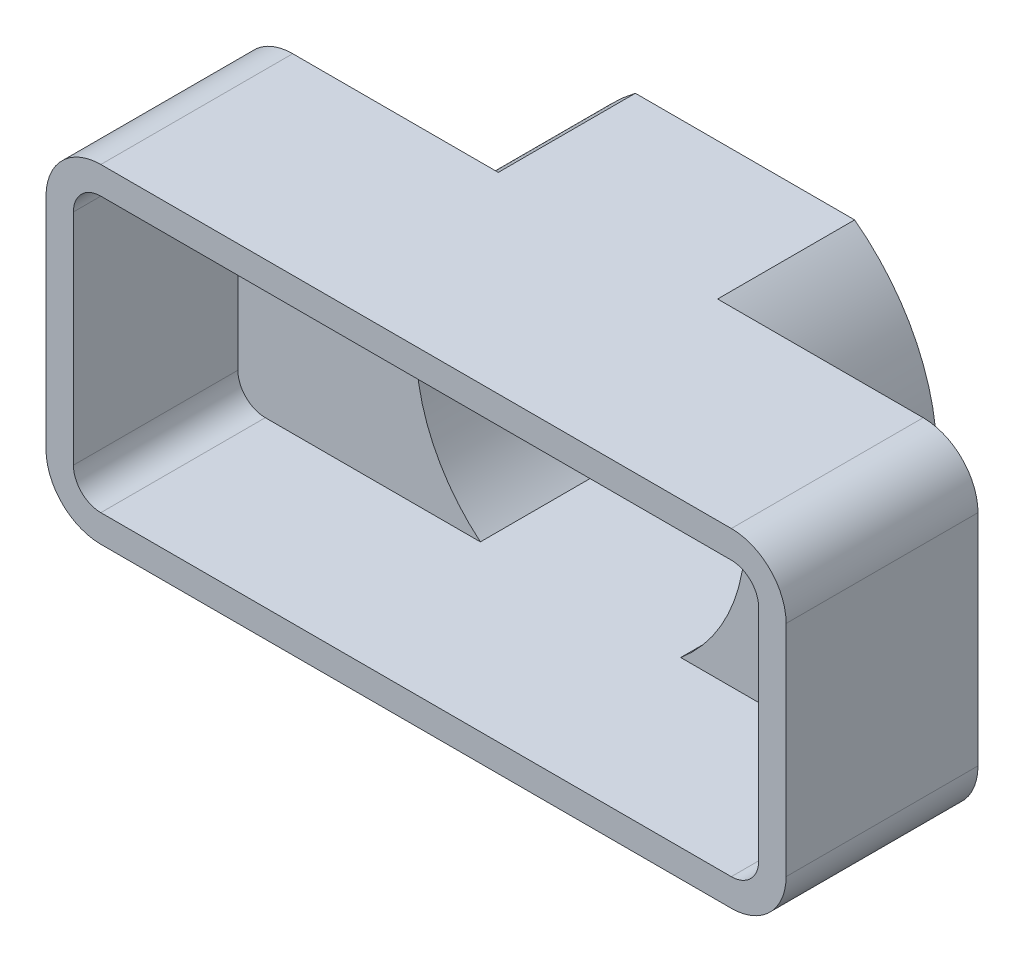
ISO-10303-21;
HEADER;
FILE_DESCRIPTION(('STEP AP214'),'2;1');
FILE_NAME('part.step','',(''),(''),'','','');
FILE_SCHEMA(('AUTOMOTIVE_DESIGN { 1 0 10303 214 1 1 1 1 }'));
ENDSEC;
DATA;
#1=APPLICATION_CONTEXT('core data for automotive mechanical design processes');
#2=APPLICATION_PROTOCOL_DEFINITION('international standard','automotive_design',2000,#1);
#3=PRODUCT_CONTEXT('',#1,'mechanical');
#4=PRODUCT('Part','Part','',(#3));
#5=PRODUCT_RELATED_PRODUCT_CATEGORY('part','',(#4));
#6=PRODUCT_DEFINITION_FORMATION('','',#4);
#7=PRODUCT_DEFINITION_CONTEXT('part definition',#1,'design');
#8=PRODUCT_DEFINITION('design','',#6,#7);
#9=PRODUCT_DEFINITION_SHAPE('','',#8);
#10=(LENGTH_UNIT() NAMED_UNIT(*) SI_UNIT(.MILLI.,.METRE.));
#11=(NAMED_UNIT(*) PLANE_ANGLE_UNIT() SI_UNIT($,.RADIAN.));
#12=(NAMED_UNIT(*) SI_UNIT($,.STERADIAN.) SOLID_ANGLE_UNIT());
#13=UNCERTAINTY_MEASURE_WITH_UNIT(LENGTH_MEASURE(1.E-05),#10,'distance_accuracy_value','');
#14=(GEOMETRIC_REPRESENTATION_CONTEXT(3) GLOBAL_UNCERTAINTY_ASSIGNED_CONTEXT((#13)) GLOBAL_UNIT_ASSIGNED_CONTEXT((#10,
#11,#12)) REPRESENTATION_CONTEXT('',''));
#15=CARTESIAN_POINT('',(0.,0.,0.));
#16=DIRECTION('',(0.,0.,1.));
#17=DIRECTION('',(1.,0.,0.));
#18=AXIS2_PLACEMENT_3D('',#15,#16,#17);
#19=CARTESIAN_POINT('',(-0.5,0.,5.));
#20=DIRECTION('',(0.,0.,-1.));
#21=DIRECTION('',(-1.,0.,0.));
#22=AXIS2_PLACEMENT_3D('',#19,#20,#21);
#23=CYLINDRICAL_SURFACE('',#22,6.5);
#24=DIRECTION('',(0.,0.,-1.));
#25=VECTOR('',#24,1.);
#26=CARTESIAN_POINT('',(3.65331193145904,5.,5.));
#27=LINE('',#26,#25);
#28=CARTESIAN_POINT('',(3.65331193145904,5.,6.));
#29=VERTEX_POINT('',#28);
#30=CARTESIAN_POINT('',(3.65331193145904,5.,1.));
#31=VERTEX_POINT('',#30);
#32=EDGE_CURVE('E204',#29,#31,#27,.T.);
#33=ORIENTED_EDGE('',*,*,#32,.T.);
#34=CARTESIAN_POINT('',(-0.5,0.,1.));
#35=DIRECTION('',(0.,0.,-1.));
#36=DIRECTION('',(-1.,0.,0.));
#37=AXIS2_PLACEMENT_3D('',#34,#35,#36);
#38=CIRCLE('',#37,6.5);
#39=CARTESIAN_POINT('',(3.65331193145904,-5.,1.));
#40=VERTEX_POINT('',#39);
#41=EDGE_CURVE('E192',#31,#40,#38,.T.);
#42=ORIENTED_EDGE('',*,*,#41,.T.);
#43=DIRECTION('',(0.,0.,-1.));
#44=VECTOR('',#43,1.);
#45=CARTESIAN_POINT('',(3.65331193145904,-5.,5.));
#46=LINE('',#45,#44);
#47=CARTESIAN_POINT('',(3.65331193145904,-5.,6.));
#48=VERTEX_POINT('',#47);
#49=EDGE_CURVE('E202',#48,#40,#46,.T.);
#50=ORIENTED_EDGE('',*,*,#49,.F.);
#51=CARTESIAN_POINT('',(-0.5,0.,6.));
#52=DIRECTION('',(0.,0.,-1.));
#53=DIRECTION('',(-1.,0.,0.));
#54=AXIS2_PLACEMENT_3D('',#51,#52,#53);
#55=CIRCLE('',#54,6.5);
#56=EDGE_CURVE('E256',#29,#48,#55,.T.);
#57=ORIENTED_EDGE('',*,*,#56,.F.);
#58=EDGE_LOOP('',(#33,#42,#50,#57));
#59=FACE_BOUND('',#58,.T.);
#60=ADVANCED_FACE('F31',(#59),#23,.F.);
#61=CARTESIAN_POINT('',(3.65331193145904,5.,5.));
#62=DIRECTION('',(0.,-1.,0.));
#63=DIRECTION('',(0.,0.,-1.));
#64=AXIS2_PLACEMENT_3D('',#61,#62,#63);
#65=PLANE('',#64);
#66=DIRECTION('',(0.,0.,-1.));
#67=VECTOR('',#66,1.);
#68=CARTESIAN_POINT('',(-3.65331193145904,5.,5.));
#69=LINE('',#68,#67);
#70=CARTESIAN_POINT('',(-3.65331193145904,5.,6.));
#71=VERTEX_POINT('',#70);
#72=CARTESIAN_POINT('',(-3.65331193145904,5.,1.));
#73=VERTEX_POINT('',#72);
#74=EDGE_CURVE('E215',#71,#73,#69,.T.);
#75=ORIENTED_EDGE('',*,*,#74,.T.);
#76=DIRECTION('',(1.,0.,0.));
#77=VECTOR('',#76,1.);
#78=CARTESIAN_POINT('',(3.65331193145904,5.,1.));
#79=LINE('',#78,#77);
#80=EDGE_CURVE('E206',#73,#31,#79,.T.);
#81=ORIENTED_EDGE('',*,*,#80,.T.);
#82=ORIENTED_EDGE('',*,*,#32,.F.);
#83=DIRECTION('',(-1.,0.,0.));
#84=VECTOR('',#83,1.);
#85=CARTESIAN_POINT('',(-11.5,5.,6.));
#86=LINE('',#85,#84);
#87=CARTESIAN_POINT('',(11.5,5.,6.));
#88=VERTEX_POINT('',#87);
#89=EDGE_CURVE('E701',#88,#29,#86,.T.);
#90=ORIENTED_EDGE('',*,*,#89,.F.);
#91=DIRECTION('',(0.,0.,1.));
#92=VECTOR('',#91,1.);
#93=CARTESIAN_POINT('',(11.5,5.,6.));
#94=LINE('',#93,#92);
#95=CARTESIAN_POINT('',(11.5,5.,12.));
#96=VERTEX_POINT('',#95);
#97=EDGE_CURVE('E281',#88,#96,#94,.T.);
#98=ORIENTED_EDGE('',*,*,#97,.T.);
#99=DIRECTION('',(-1.,0.,0.));
#100=VECTOR('',#99,1.);
#101=CARTESIAN_POINT('',(-3.65331193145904,5.,12.));
#102=LINE('',#101,#100);
#103=CARTESIAN_POINT('',(-11.5,5.,12.));
#104=VERTEX_POINT('',#103);
#105=EDGE_CURVE('E53',#96,#104,#102,.T.);
#106=ORIENTED_EDGE('',*,*,#105,.T.);
#107=DIRECTION('',(0.,0.,1.));
#108=VECTOR('',#107,1.);
#109=CARTESIAN_POINT('',(-11.5,5.,6.));
#110=LINE('',#109,#108);
#111=CARTESIAN_POINT('',(-11.5,5.,6.));
#112=VERTEX_POINT('',#111);
#113=EDGE_CURVE('E278',#112,#104,#110,.T.);
#114=ORIENTED_EDGE('',*,*,#113,.F.);
#115=EDGE_CURVE('E700',#71,#112,#86,.T.);
#116=ORIENTED_EDGE('',*,*,#115,.F.);
#117=EDGE_LOOP('',(#75,#81,#82,#90,#98,#106,#114,#116));
#118=FACE_BOUND('',#117,.T.);
#119=ADVANCED_FACE('F436',(#118),#65,.T.);
#120=CARTESIAN_POINT('',(0.5,0.,5.));
#121=DIRECTION('',(0.,0.,-1.));
#122=DIRECTION('',(-1.,0.,0.));
#123=AXIS2_PLACEMENT_3D('',#120,#121,#122);
#124=CYLINDRICAL_SURFACE('',#123,6.5);
#125=DIRECTION('',(0.,0.,-1.));
#126=VECTOR('',#125,1.);
#127=CARTESIAN_POINT('',(-3.65331193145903,-5.,5.));
#128=LINE('',#127,#126);
#129=CARTESIAN_POINT('',(-3.65331193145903,-5.,6.));
#130=VERTEX_POINT('',#129);
#131=CARTESIAN_POINT('',(-3.65331193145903,-5.,1.));
#132=VERTEX_POINT('',#131);
#133=EDGE_CURVE('E212',#130,#132,#128,.T.);
#134=ORIENTED_EDGE('',*,*,#133,.T.);
#135=CARTESIAN_POINT('',(0.5,0.,1.));
#136=DIRECTION('',(0.,0.,-1.));
#137=DIRECTION('',(-1.,0.,0.));
#138=AXIS2_PLACEMENT_3D('',#135,#136,#137);
#139=CIRCLE('',#138,6.5);
#140=EDGE_CURVE('E46',#132,#73,#139,.T.);
#141=ORIENTED_EDGE('',*,*,#140,.T.);
#142=ORIENTED_EDGE('',*,*,#74,.F.);
#143=CARTESIAN_POINT('',(0.5,0.,6.));
#144=DIRECTION('',(0.,0.,-1.));
#145=DIRECTION('',(-1.,0.,0.));
#146=AXIS2_PLACEMENT_3D('',#143,#144,#145);
#147=CIRCLE('',#146,6.5);
#148=EDGE_CURVE('E252',#130,#71,#147,.T.);
#149=ORIENTED_EDGE('',*,*,#148,.F.);
#150=EDGE_LOOP('',(#134,#141,#142,#149));
#151=FACE_BOUND('',#150,.T.);
#152=ADVANCED_FACE('F441',(#151),#124,.F.);
#153=CARTESIAN_POINT('',(3.65331193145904,-5.,5.));
#154=DIRECTION('',(0.,1.,0.));
#155=DIRECTION('',(0.,0.,1.));
#156=AXIS2_PLACEMENT_3D('',#153,#154,#155);
#157=PLANE('',#156);
#158=ORIENTED_EDGE('',*,*,#49,.T.);
#159=DIRECTION('',(-1.,0.,0.));
#160=VECTOR('',#159,1.);
#161=CARTESIAN_POINT('',(3.65331193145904,-5.,1.));
#162=LINE('',#161,#160);
#163=EDGE_CURVE('E11',#40,#132,#162,.T.);
#164=ORIENTED_EDGE('',*,*,#163,.T.);
#165=ORIENTED_EDGE('',*,*,#133,.F.);
#166=DIRECTION('',(1.,0.,0.));
#167=VECTOR('',#166,1.);
#168=CARTESIAN_POINT('',(-11.5,-5.,6.));
#169=LINE('',#168,#167);
#170=CARTESIAN_POINT('',(-11.5,-5.,6.));
#171=VERTEX_POINT('',#170);
#172=EDGE_CURVE('E712',#171,#130,#169,.T.);
#173=ORIENTED_EDGE('',*,*,#172,.F.);
#174=DIRECTION('',(0.,0.,1.));
#175=VECTOR('',#174,1.);
#176=CARTESIAN_POINT('',(-11.5,-5.,6.));
#177=LINE('',#176,#175);
#178=CARTESIAN_POINT('',(-11.5,-5.,12.));
#179=VERTEX_POINT('',#178);
#180=EDGE_CURVE('E271',#171,#179,#177,.T.);
#181=ORIENTED_EDGE('',*,*,#180,.T.);
#182=DIRECTION('',(1.,0.,0.));
#183=VECTOR('',#182,1.);
#184=CARTESIAN_POINT('',(-3.65331193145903,-5.,12.));
#185=LINE('',#184,#183);
#186=CARTESIAN_POINT('',(11.5,-5.,12.));
#187=VERTEX_POINT('',#186);
#188=EDGE_CURVE('E289',#179,#187,#185,.T.);
#189=ORIENTED_EDGE('',*,*,#188,.T.);
#190=DIRECTION('',(0.,0.,1.));
#191=VECTOR('',#190,1.);
#192=CARTESIAN_POINT('',(11.5,-5.,6.));
#193=LINE('',#192,#191);
#194=CARTESIAN_POINT('',(11.5,-5.,6.));
#195=VERTEX_POINT('',#194);
#196=EDGE_CURVE('E263',#195,#187,#193,.T.);
#197=ORIENTED_EDGE('',*,*,#196,.F.);
#198=EDGE_CURVE('E211',#48,#195,#169,.T.);
#199=ORIENTED_EDGE('',*,*,#198,.F.);
#200=EDGE_LOOP('',(#158,#164,#165,#173,#181,#189,#197,#199));
#201=FACE_BOUND('',#200,.T.);
#202=ADVANCED_FACE('F209',(#201),#157,.T.);
#203=CARTESIAN_POINT('',(-0.5,0.,0.));
#204=DIRECTION('',(0.,0.,-1.));
#205=DIRECTION('',(-1.,0.,0.));
#206=AXIS2_PLACEMENT_3D('',#203,#204,#205);
#207=PLANE('',#206);
#208=CARTESIAN_POINT('',(-0.5,0.,0.));
#209=DIRECTION('',(0.,0.,1.));
#210=DIRECTION('',(-1.,0.,0.));
#211=AXIS2_PLACEMENT_3D('',#208,#209,#210);
#212=CIRCLE('',#211,7.5);
#213=CARTESIAN_POINT('',(4.,-6.,0.));
#214=VERTEX_POINT('',#213);
#215=CARTESIAN_POINT('',(4.,6.,0.));
#216=VERTEX_POINT('',#215);
#217=EDGE_CURVE('E228',#214,#216,#212,.T.);
#218=ORIENTED_EDGE('',*,*,#217,.F.);
#219=DIRECTION('',(1.,0.,0.));
#220=VECTOR('',#219,1.);
#221=CARTESIAN_POINT('',(4.,-6.,0.));
#222=LINE('',#221,#220);
#223=CARTESIAN_POINT('',(-4.,-6.,0.));
#224=VERTEX_POINT('',#223);
#225=EDGE_CURVE('E239',#224,#214,#222,.T.);
#226=ORIENTED_EDGE('',*,*,#225,.F.);
#227=CARTESIAN_POINT('',(0.5,0.,0.));
#228=DIRECTION('',(0.,0.,1.));
#229=DIRECTION('',(1.,0.,0.));
#230=AXIS2_PLACEMENT_3D('',#227,#228,#229);
#231=CIRCLE('',#230,7.5);
#232=CARTESIAN_POINT('',(-4.,6.,0.));
#233=VERTEX_POINT('',#232);
#234=EDGE_CURVE('E397',#233,#224,#231,.T.);
#235=ORIENTED_EDGE('',*,*,#234,.F.);
#236=DIRECTION('',(-1.,0.,0.));
#237=VECTOR('',#236,1.);
#238=CARTESIAN_POINT('',(4.,6.,0.));
#239=LINE('',#238,#237);
#240=EDGE_CURVE('E387',#216,#233,#239,.T.);
#241=ORIENTED_EDGE('',*,*,#240,.F.);
#242=EDGE_LOOP('',(#218,#226,#235,#241));
#243=FACE_BOUND('',#242,.T.);
#244=CARTESIAN_POINT('',(0.,0.,0.));
#245=DIRECTION('',(0.,0.,-1.));
#246=DIRECTION('',(-1.,0.,0.));
#247=AXIS2_PLACEMENT_3D('',#244,#245,#246);
#248=CIRCLE('',#247,1.);
#249=CARTESIAN_POINT('',(-1.,0.,0.));
#250=VERTEX_POINT('',#249);
#251=EDGE_CURVE('E691',#250,#250,#248,.T.);
#252=ORIENTED_EDGE('',*,*,#251,.F.);
#253=EDGE_LOOP('',(#252));
#254=FACE_BOUND('',#253,.T.);
#255=ADVANCED_FACE('F405',(#243,#254),#207,.T.);
#256=CARTESIAN_POINT('',(-0.5,0.,5.));
#257=DIRECTION('',(0.,0.,-1.));
#258=DIRECTION('',(-1.,0.,0.));
#259=AXIS2_PLACEMENT_3D('',#256,#257,#258);
#260=CYLINDRICAL_SURFACE('',#259,7.5);
#261=ORIENTED_EDGE('',*,*,#217,.T.);
#262=DIRECTION('',(0.,0.,-1.));
#263=VECTOR('',#262,1.);
#264=CARTESIAN_POINT('',(4.,6.,5.));
#265=LINE('',#264,#263);
#266=CARTESIAN_POINT('',(4.,6.,5.));
#267=VERTEX_POINT('',#266);
#268=EDGE_CURVE('E39',#267,#216,#265,.T.);
#269=ORIENTED_EDGE('',*,*,#268,.F.);
#270=CARTESIAN_POINT('',(-0.5,0.,5.));
#271=DIRECTION('',(0.,0.,1.));
#272=DIRECTION('',(-1.,0.,0.));
#273=AXIS2_PLACEMENT_3D('',#270,#271,#272);
#274=CIRCLE('',#273,7.5);
#275=CARTESIAN_POINT('',(4.,-6.,5.));
#276=VERTEX_POINT('',#275);
#277=EDGE_CURVE('E234',#276,#267,#274,.T.);
#278=ORIENTED_EDGE('',*,*,#277,.F.);
#279=DIRECTION('',(0.,0.,-1.));
#280=VECTOR('',#279,1.);
#281=CARTESIAN_POINT('',(4.,-6.,5.));
#282=LINE('',#281,#280);
#283=EDGE_CURVE('E246',#276,#214,#282,.T.);
#284=ORIENTED_EDGE('',*,*,#283,.T.);
#285=EDGE_LOOP('',(#261,#269,#278,#284));
#286=FACE_BOUND('',#285,.T.);
#287=ADVANCED_FACE('F33',(#286),#260,.T.);
#288=CARTESIAN_POINT('',(4.,6.,5.));
#289=DIRECTION('',(0.,-1.,0.));
#290=DIRECTION('',(1.,0.,0.));
#291=AXIS2_PLACEMENT_3D('',#288,#289,#290);
#292=PLANE('',#291);
#293=ORIENTED_EDGE('',*,*,#240,.T.);
#294=DIRECTION('',(0.,0.,-1.));
#295=VECTOR('',#294,1.);
#296=CARTESIAN_POINT('',(-4.,6.,5.));
#297=LINE('',#296,#295);
#298=CARTESIAN_POINT('',(-4.,6.,5.));
#299=VERTEX_POINT('',#298);
#300=EDGE_CURVE('E243',#299,#233,#297,.T.);
#301=ORIENTED_EDGE('',*,*,#300,.F.);
#302=DIRECTION('',(-1.,0.,0.));
#303=VECTOR('',#302,1.);
#304=CARTESIAN_POINT('',(-11.5,6.,5.));
#305=LINE('',#304,#303);
#306=CARTESIAN_POINT('',(-11.5,6.,5.));
#307=VERTEX_POINT('',#306);
#308=EDGE_CURVE('E325',#299,#307,#305,.T.);
#309=ORIENTED_EDGE('',*,*,#308,.T.);
#310=DIRECTION('',(0.,0.,-1.));
#311=VECTOR('',#310,1.);
#312=CARTESIAN_POINT('',(-11.5,6.,12.));
#313=LINE('',#312,#311);
#314=CARTESIAN_POINT('',(-11.5,6.,12.));
#315=VERTEX_POINT('',#314);
#316=EDGE_CURVE('E311',#315,#307,#313,.T.);
#317=ORIENTED_EDGE('',*,*,#316,.F.);
#318=DIRECTION('',(-1.,0.,0.));
#319=VECTOR('',#318,1.);
#320=CARTESIAN_POINT('',(-11.5,6.,12.));
#321=LINE('',#320,#319);
#322=CARTESIAN_POINT('',(11.5,6.,12.));
#323=VERTEX_POINT('',#322);
#324=EDGE_CURVE('E309',#323,#315,#321,.T.);
#325=ORIENTED_EDGE('',*,*,#324,.F.);
#326=DIRECTION('',(0.,0.,-1.));
#327=VECTOR('',#326,1.);
#328=CARTESIAN_POINT('',(11.5,6.,12.));
#329=LINE('',#328,#327);
#330=CARTESIAN_POINT('',(11.5,6.,5.));
#331=VERTEX_POINT('',#330);
#332=EDGE_CURVE('E335',#323,#331,#329,.T.);
#333=ORIENTED_EDGE('',*,*,#332,.T.);
#334=EDGE_CURVE('E297',#331,#267,#305,.T.);
#335=ORIENTED_EDGE('',*,*,#334,.T.);
#336=ORIENTED_EDGE('',*,*,#268,.T.);
#337=EDGE_LOOP('',(#293,#301,#309,#317,#325,#333,#335,#336));
#338=FACE_BOUND('',#337,.T.);
#339=ADVANCED_FACE('F384',(#338),#292,.F.);
#340=CARTESIAN_POINT('',(0.5,0.,5.));
#341=DIRECTION('',(0.,0.,-1.));
#342=DIRECTION('',(-1.,0.,0.));
#343=AXIS2_PLACEMENT_3D('',#340,#341,#342);
#344=CYLINDRICAL_SURFACE('',#343,7.5);
#345=ORIENTED_EDGE('',*,*,#234,.T.);
#346=DIRECTION('',(0.,0.,-1.));
#347=VECTOR('',#346,1.);
#348=CARTESIAN_POINT('',(-4.,-6.,5.));
#349=LINE('',#348,#347);
#350=CARTESIAN_POINT('',(-4.,-6.,5.));
#351=VERTEX_POINT('',#350);
#352=EDGE_CURVE('E248',#351,#224,#349,.T.);
#353=ORIENTED_EDGE('',*,*,#352,.F.);
#354=CARTESIAN_POINT('',(0.5,0.,5.));
#355=DIRECTION('',(0.,0.,1.));
#356=DIRECTION('',(1.,0.,0.));
#357=AXIS2_PLACEMENT_3D('',#354,#355,#356);
#358=CIRCLE('',#357,7.5);
#359=EDGE_CURVE('E238',#299,#351,#358,.T.);
#360=ORIENTED_EDGE('',*,*,#359,.F.);
#361=ORIENTED_EDGE('',*,*,#300,.T.);
#362=EDGE_LOOP('',(#345,#353,#360,#361));
#363=FACE_BOUND('',#362,.T.);
#364=ADVANCED_FACE('F390',(#363),#344,.T.);
#365=CARTESIAN_POINT('',(4.,-6.,5.));
#366=DIRECTION('',(0.,1.,0.));
#367=DIRECTION('',(-1.,0.,0.));
#368=AXIS2_PLACEMENT_3D('',#365,#366,#367);
#369=PLANE('',#368);
#370=ORIENTED_EDGE('',*,*,#225,.T.);
#371=ORIENTED_EDGE('',*,*,#283,.F.);
#372=DIRECTION('',(1.,0.,0.));
#373=VECTOR('',#372,1.);
#374=CARTESIAN_POINT('',(-11.5,-6.,5.));
#375=LINE('',#374,#373);
#376=CARTESIAN_POINT('',(11.5,-6.,5.));
#377=VERTEX_POINT('',#376);
#378=EDGE_CURVE('E221',#276,#377,#375,.T.);
#379=ORIENTED_EDGE('',*,*,#378,.T.);
#380=DIRECTION('',(0.,0.,-1.));
#381=VECTOR('',#380,1.);
#382=CARTESIAN_POINT('',(11.5,-6.,12.));
#383=LINE('',#382,#381);
#384=CARTESIAN_POINT('',(11.5,-6.,12.));
#385=VERTEX_POINT('',#384);
#386=EDGE_CURVE('E344',#385,#377,#383,.T.);
#387=ORIENTED_EDGE('',*,*,#386,.F.);
#388=DIRECTION('',(1.,0.,0.));
#389=VECTOR('',#388,1.);
#390=CARTESIAN_POINT('',(-11.5,-6.,12.));
#391=LINE('',#390,#389);
#392=CARTESIAN_POINT('',(-11.5,-6.,12.));
#393=VERTEX_POINT('',#392);
#394=EDGE_CURVE('E301',#393,#385,#391,.T.);
#395=ORIENTED_EDGE('',*,*,#394,.F.);
#396=DIRECTION('',(0.,0.,-1.));
#397=VECTOR('',#396,1.);
#398=CARTESIAN_POINT('',(-11.5,-6.,12.));
#399=LINE('',#398,#397);
#400=CARTESIAN_POINT('',(-11.5,-6.,5.));
#401=VERTEX_POINT('',#400);
#402=EDGE_CURVE('E347',#393,#401,#399,.T.);
#403=ORIENTED_EDGE('',*,*,#402,.T.);
#404=EDGE_CURVE('E322',#401,#351,#375,.T.);
#405=ORIENTED_EDGE('',*,*,#404,.T.);
#406=ORIENTED_EDGE('',*,*,#352,.T.);
#407=EDGE_LOOP('',(#370,#371,#379,#387,#395,#403,#405,#406));
#408=FACE_BOUND('',#407,.T.);
#409=ADVANCED_FACE('F368',(#408),#369,.F.);
#410=CARTESIAN_POINT('',(-11.5,4.,5.));
#411=DIRECTION('',(0.,0.,-1.));
#412=DIRECTION('',(-1.,0.,0.));
#413=AXIS2_PLACEMENT_3D('',#410,#411,#412);
#414=PLANE('',#413);
#415=ORIENTED_EDGE('',*,*,#378,.F.);
#416=ORIENTED_EDGE('',*,*,#277,.T.);
#417=ORIENTED_EDGE('',*,*,#334,.F.);
#418=CARTESIAN_POINT('',(11.5,4.,5.));
#419=DIRECTION('',(0.,0.,1.));
#420=DIRECTION('',(-1.,0.,0.));
#421=AXIS2_PLACEMENT_3D('',#418,#419,#420);
#422=CIRCLE('',#421,2.);
#423=CARTESIAN_POINT('',(13.5,4.,5.));
#424=VERTEX_POINT('',#423);
#425=EDGE_CURVE('E328',#424,#331,#422,.T.);
#426=ORIENTED_EDGE('',*,*,#425,.F.);
#427=DIRECTION('',(0.,1.,0.));
#428=VECTOR('',#427,1.);
#429=CARTESIAN_POINT('',(13.5,-4.,5.));
#430=LINE('',#429,#428);
#431=CARTESIAN_POINT('',(13.5,-4.,5.));
#432=VERTEX_POINT('',#431);
#433=EDGE_CURVE('E415',#432,#424,#430,.T.);
#434=ORIENTED_EDGE('',*,*,#433,.F.);
#435=CARTESIAN_POINT('',(11.5,-4.,5.));
#436=DIRECTION('',(0.,0.,1.));
#437=DIRECTION('',(1.,0.,0.));
#438=AXIS2_PLACEMENT_3D('',#435,#436,#437);
#439=CIRCLE('',#438,2.);
#440=EDGE_CURVE('E319',#377,#432,#439,.T.);
#441=ORIENTED_EDGE('',*,*,#440,.F.);
#442=EDGE_LOOP('',(#415,#416,#417,#426,#434,#441));
#443=FACE_BOUND('',#442,.T.);
#444=ADVANCED_FACE('F412',(#443),#414,.T.);
#445=CARTESIAN_POINT('',(-11.5,4.,12.));
#446=DIRECTION('',(0.,0.,-1.));
#447=DIRECTION('',(-1.,0.,0.));
#448=AXIS2_PLACEMENT_3D('',#445,#446,#447);
#449=PLANE('',#448);
#450=ORIENTED_EDGE('',*,*,#188,.F.);
#451=CARTESIAN_POINT('',(-11.5,-4.,12.));
#452=DIRECTION('',(0.,0.,1.));
#453=DIRECTION('',(-1.,0.,0.));
#454=AXIS2_PLACEMENT_3D('',#451,#452,#453);
#455=CIRCLE('',#454,0.999999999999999);
#456=CARTESIAN_POINT('',(-12.5,-4.,12.));
#457=VERTEX_POINT('',#456);
#458=EDGE_CURVE('E726',#457,#179,#455,.T.);
#459=ORIENTED_EDGE('',*,*,#458,.F.);
#460=DIRECTION('',(0.,-1.,0.));
#461=VECTOR('',#460,1.);
#462=CARTESIAN_POINT('',(-12.5,-4.,12.));
#463=LINE('',#462,#461);
#464=CARTESIAN_POINT('',(-12.5,4.,12.));
#465=VERTEX_POINT('',#464);
#466=EDGE_CURVE('E723',#465,#457,#463,.T.);
#467=ORIENTED_EDGE('',*,*,#466,.F.);
#468=CARTESIAN_POINT('',(-11.5,4.,12.));
#469=DIRECTION('',(0.,0.,1.));
#470=DIRECTION('',(-1.,0.,0.));
#471=AXIS2_PLACEMENT_3D('',#468,#469,#470);
#472=CIRCLE('',#471,0.999999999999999);
#473=EDGE_CURVE('E720',#104,#465,#472,.T.);
#474=ORIENTED_EDGE('',*,*,#473,.F.);
#475=ORIENTED_EDGE('',*,*,#105,.F.);
#476=CARTESIAN_POINT('',(11.5,4.,12.));
#477=DIRECTION('',(0.,0.,1.));
#478=DIRECTION('',(-1.,0.,0.));
#479=AXIS2_PLACEMENT_3D('',#476,#477,#478);
#480=CIRCLE('',#479,0.999999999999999);
#481=CARTESIAN_POINT('',(12.5,4.,12.));
#482=VERTEX_POINT('',#481);
#483=EDGE_CURVE('E205',#482,#96,#480,.T.);
#484=ORIENTED_EDGE('',*,*,#483,.F.);
#485=DIRECTION('',(0.,1.,0.));
#486=VECTOR('',#485,1.);
#487=CARTESIAN_POINT('',(12.5,-4.,12.));
#488=LINE('',#487,#486);
#489=CARTESIAN_POINT('',(12.5,-4.,12.));
#490=VERTEX_POINT('',#489);
#491=EDGE_CURVE('E266',#490,#482,#488,.T.);
#492=ORIENTED_EDGE('',*,*,#491,.F.);
#493=CARTESIAN_POINT('',(11.5,-4.,12.));
#494=DIRECTION('',(0.,0.,1.));
#495=DIRECTION('',(1.,0.,0.));
#496=AXIS2_PLACEMENT_3D('',#493,#494,#495);
#497=CIRCLE('',#496,0.999999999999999);
#498=EDGE_CURVE('E728',#187,#490,#497,.T.);
#499=ORIENTED_EDGE('',*,*,#498,.F.);
#500=EDGE_LOOP('',(#450,#459,#467,#474,#475,#484,#492,#499));
#501=FACE_BOUND('',#500,.T.);
#502=CARTESIAN_POINT('',(-11.5,4.,12.));
#503=DIRECTION('',(0.,0.,1.));
#504=DIRECTION('',(-1.,0.,0.));
#505=AXIS2_PLACEMENT_3D('',#502,#503,#504);
#506=CIRCLE('',#505,2.);
#507=CARTESIAN_POINT('',(-13.5,4.,12.));
#508=VERTEX_POINT('',#507);
#509=EDGE_CURVE('E293',#315,#508,#506,.T.);
#510=ORIENTED_EDGE('',*,*,#509,.T.);
#511=DIRECTION('',(0.,-1.,0.));
#512=VECTOR('',#511,1.);
#513=CARTESIAN_POINT('',(-13.5,-4.,12.));
#514=LINE('',#513,#512);
#515=CARTESIAN_POINT('',(-13.5,-4.,12.));
#516=VERTEX_POINT('',#515);
#517=EDGE_CURVE('E296',#508,#516,#514,.T.);
#518=ORIENTED_EDGE('',*,*,#517,.T.);
#519=CARTESIAN_POINT('',(-11.5,-4.,12.));
#520=DIRECTION('',(0.,0.,1.));
#521=DIRECTION('',(-1.,0.,0.));
#522=AXIS2_PLACEMENT_3D('',#519,#520,#521);
#523=CIRCLE('',#522,2.);
#524=EDGE_CURVE('E299',#516,#393,#523,.T.);
#525=ORIENTED_EDGE('',*,*,#524,.T.);
#526=ORIENTED_EDGE('',*,*,#394,.T.);
#527=CARTESIAN_POINT('',(11.5,-4.,12.));
#528=DIRECTION('',(0.,0.,1.));
#529=DIRECTION('',(1.,0.,0.));
#530=AXIS2_PLACEMENT_3D('',#527,#528,#529);
#531=CIRCLE('',#530,2.);
#532=CARTESIAN_POINT('',(13.5,-4.,12.));
#533=VERTEX_POINT('',#532);
#534=EDGE_CURVE('E303',#385,#533,#531,.T.);
#535=ORIENTED_EDGE('',*,*,#534,.T.);
#536=DIRECTION('',(0.,1.,0.));
#537=VECTOR('',#536,1.);
#538=CARTESIAN_POINT('',(13.5,-4.,12.));
#539=LINE('',#538,#537);
#540=CARTESIAN_POINT('',(13.5,4.,12.));
#541=VERTEX_POINT('',#540);
#542=EDGE_CURVE('E305',#533,#541,#539,.T.);
#543=ORIENTED_EDGE('',*,*,#542,.T.);
#544=CARTESIAN_POINT('',(11.5,4.,12.));
#545=DIRECTION('',(0.,0.,1.));
#546=DIRECTION('',(-1.,0.,0.));
#547=AXIS2_PLACEMENT_3D('',#544,#545,#546);
#548=CIRCLE('',#547,2.);
#549=EDGE_CURVE('E307',#541,#323,#548,.T.);
#550=ORIENTED_EDGE('',*,*,#549,.T.);
#551=ORIENTED_EDGE('',*,*,#324,.T.);
#552=EDGE_LOOP('',(#510,#518,#525,#526,#535,#543,#550,#551));
#553=FACE_BOUND('',#552,.T.);
#554=ADVANCED_FACE('F374',(#501,#553),#449,.F.);
#555=ORIENTED_EDGE('',*,*,#308,.F.);
#556=ORIENTED_EDGE('',*,*,#359,.T.);
#557=ORIENTED_EDGE('',*,*,#404,.F.);
#558=CARTESIAN_POINT('',(-11.5,-4.,5.));
#559=DIRECTION('',(0.,0.,1.));
#560=DIRECTION('',(-1.,0.,0.));
#561=AXIS2_PLACEMENT_3D('',#558,#559,#560);
#562=CIRCLE('',#561,2.);
#563=CARTESIAN_POINT('',(-13.5,-4.,5.));
#564=VERTEX_POINT('',#563);
#565=EDGE_CURVE('E316',#564,#401,#562,.T.);
#566=ORIENTED_EDGE('',*,*,#565,.F.);
#567=DIRECTION('',(0.,-1.,0.));
#568=VECTOR('',#567,1.);
#569=CARTESIAN_POINT('',(-13.5,-4.,5.));
#570=LINE('',#569,#568);
#571=CARTESIAN_POINT('',(-13.5,4.,5.));
#572=VERTEX_POINT('',#571);
#573=EDGE_CURVE('E314',#572,#564,#570,.T.);
#574=ORIENTED_EDGE('',*,*,#573,.F.);
#575=CARTESIAN_POINT('',(-11.5,4.,5.));
#576=DIRECTION('',(0.,0.,1.));
#577=DIRECTION('',(-1.,0.,0.));
#578=AXIS2_PLACEMENT_3D('',#575,#576,#577);
#579=CIRCLE('',#578,2.);
#580=EDGE_CURVE('E292',#307,#572,#579,.T.);
#581=ORIENTED_EDGE('',*,*,#580,.F.);
#582=EDGE_LOOP('',(#555,#556,#557,#566,#574,#581));
#583=FACE_BOUND('',#582,.T.);
#584=CARTESIAN_POINT('',(-11.5,0.,5.));
#585=DIRECTION('',(0.,0.,1.));
#586=DIRECTION('',(1.,0.,0.));
#587=AXIS2_PLACEMENT_3D('',#584,#585,#586);
#588=CIRCLE('',#587,0.500000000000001);
#589=CARTESIAN_POINT('',(-11.,0.,5.));
#590=VERTEX_POINT('',#589);
#591=EDGE_CURVE('E286',#590,#590,#588,.T.);
#592=ORIENTED_EDGE('',*,*,#591,.T.);
#593=EDGE_LOOP('',(#592));
#594=FACE_BOUND('',#593,.T.);
#595=ADVANCED_FACE('F361',(#583,#594),#414,.T.);
#596=CARTESIAN_POINT('',(-11.5,4.,12.));
#597=DIRECTION('',(0.,0.,-1.));
#598=DIRECTION('',(-1.,0.,0.));
#599=AXIS2_PLACEMENT_3D('',#596,#597,#598);
#600=CYLINDRICAL_SURFACE('',#599,2.);
#601=ORIENTED_EDGE('',*,*,#580,.T.);
#602=DIRECTION('',(0.,0.,-1.));
#603=VECTOR('',#602,1.);
#604=CARTESIAN_POINT('',(-13.5,4.,12.));
#605=LINE('',#604,#603);
#606=EDGE_CURVE('E213',#508,#572,#605,.T.);
#607=ORIENTED_EDGE('',*,*,#606,.F.);
#608=ORIENTED_EDGE('',*,*,#509,.F.);
#609=ORIENTED_EDGE('',*,*,#316,.T.);
#610=EDGE_LOOP('',(#601,#607,#608,#609));
#611=FACE_BOUND('',#610,.T.);
#612=ADVANCED_FACE('F380',(#611),#600,.T.);
#613=CARTESIAN_POINT('',(-13.5,-4.,12.));
#614=DIRECTION('',(1.,0.,0.));
#615=DIRECTION('',(0.,0.,-1.));
#616=AXIS2_PLACEMENT_3D('',#613,#614,#615);
#617=PLANE('',#616);
#618=ORIENTED_EDGE('',*,*,#573,.T.);
#619=DIRECTION('',(0.,0.,-1.));
#620=VECTOR('',#619,1.);
#621=CARTESIAN_POINT('',(-13.5,-4.,12.));
#622=LINE('',#621,#620);
#623=EDGE_CURVE('E218',#516,#564,#622,.T.);
#624=ORIENTED_EDGE('',*,*,#623,.F.);
#625=ORIENTED_EDGE('',*,*,#517,.F.);
#626=ORIENTED_EDGE('',*,*,#606,.T.);
#627=EDGE_LOOP('',(#618,#624,#625,#626));
#628=FACE_BOUND('',#627,.T.);
#629=ADVANCED_FACE('F378',(#628),#617,.F.);
#630=CARTESIAN_POINT('',(-11.5,-4.,12.));
#631=DIRECTION('',(0.,0.,-1.));
#632=DIRECTION('',(-1.,0.,0.));
#633=AXIS2_PLACEMENT_3D('',#630,#631,#632);
#634=CYLINDRICAL_SURFACE('',#633,2.);
#635=ORIENTED_EDGE('',*,*,#565,.T.);
#636=ORIENTED_EDGE('',*,*,#402,.F.);
#637=ORIENTED_EDGE('',*,*,#524,.F.);
#638=ORIENTED_EDGE('',*,*,#623,.T.);
#639=EDGE_LOOP('',(#635,#636,#637,#638));
#640=FACE_BOUND('',#639,.T.);
#641=ADVANCED_FACE('F355',(#640),#634,.T.);
#642=CARTESIAN_POINT('',(11.5,-4.,12.));
#643=DIRECTION('',(0.,0.,-1.));
#644=DIRECTION('',(-1.,0.,0.));
#645=AXIS2_PLACEMENT_3D('',#642,#643,#644);
#646=CYLINDRICAL_SURFACE('',#645,2.);
#647=ORIENTED_EDGE('',*,*,#440,.T.);
#648=DIRECTION('',(0.,0.,-1.));
#649=VECTOR('',#648,1.);
#650=CARTESIAN_POINT('',(13.5,-4.,12.));
#651=LINE('',#650,#649);
#652=EDGE_CURVE('E341',#533,#432,#651,.T.);
#653=ORIENTED_EDGE('',*,*,#652,.F.);
#654=ORIENTED_EDGE('',*,*,#534,.F.);
#655=ORIENTED_EDGE('',*,*,#386,.T.);
#656=EDGE_LOOP('',(#647,#653,#654,#655));
#657=FACE_BOUND('',#656,.T.);
#658=ADVANCED_FACE('F426',(#657),#646,.T.);
#659=CARTESIAN_POINT('',(13.5,-4.,12.));
#660=DIRECTION('',(-1.,0.,0.));
#661=DIRECTION('',(0.,0.,1.));
#662=AXIS2_PLACEMENT_3D('',#659,#660,#661);
#663=PLANE('',#662);
#664=ORIENTED_EDGE('',*,*,#433,.T.);
#665=DIRECTION('',(0.,0.,-1.));
#666=VECTOR('',#665,1.);
#667=CARTESIAN_POINT('',(13.5,4.,12.));
#668=LINE('',#667,#666);
#669=EDGE_CURVE('E338',#541,#424,#668,.T.);
#670=ORIENTED_EDGE('',*,*,#669,.F.);
#671=ORIENTED_EDGE('',*,*,#542,.F.);
#672=ORIENTED_EDGE('',*,*,#652,.T.);
#673=EDGE_LOOP('',(#664,#670,#671,#672));
#674=FACE_BOUND('',#673,.T.);
#675=ADVANCED_FACE('F424',(#674),#663,.F.);
#676=CARTESIAN_POINT('',(11.5,4.,12.));
#677=DIRECTION('',(0.,0.,-1.));
#678=DIRECTION('',(-1.,0.,0.));
#679=AXIS2_PLACEMENT_3D('',#676,#677,#678);
#680=CYLINDRICAL_SURFACE('',#679,2.);
#681=ORIENTED_EDGE('',*,*,#425,.T.);
#682=ORIENTED_EDGE('',*,*,#332,.F.);
#683=ORIENTED_EDGE('',*,*,#549,.F.);
#684=ORIENTED_EDGE('',*,*,#669,.T.);
#685=EDGE_LOOP('',(#681,#682,#683,#684));
#686=FACE_BOUND('',#685,.T.);
#687=ADVANCED_FACE('F421',(#686),#680,.T.);
#688=CARTESIAN_POINT('',(-11.5,0.,12.));
#689=DIRECTION('',(0.,0.,-1.));
#690=DIRECTION('',(-1.,0.,0.));
#691=AXIS2_PLACEMENT_3D('',#688,#689,#690);
#692=CYLINDRICAL_SURFACE('',#691,0.500000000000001);
#693=CARTESIAN_POINT('',(-11.5,0.,6.));
#694=DIRECTION('',(0.,0.,-1.));
#695=DIRECTION('',(-1.,0.,0.));
#696=AXIS2_PLACEMENT_3D('',#693,#694,#695);
#697=CIRCLE('',#696,0.500000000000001);
#698=CARTESIAN_POINT('',(-12.,0.,6.));
#699=VERTEX_POINT('',#698);
#700=EDGE_CURVE('E250',#699,#699,#697,.T.);
#701=ORIENTED_EDGE('',*,*,#700,.F.);
#702=EDGE_LOOP('',(#701));
#703=FACE_BOUND('',#702,.T.);
#704=ORIENTED_EDGE('',*,*,#591,.F.);
#705=EDGE_LOOP('',(#704));
#706=FACE_BOUND('',#705,.T.);
#707=ADVANCED_FACE('F432',(#703,#706),#692,.F.);
#708=CARTESIAN_POINT('',(11.5,4.,6.));
#709=DIRECTION('',(0.,0.,-1.));
#710=DIRECTION('',(-1.,0.,0.));
#711=AXIS2_PLACEMENT_3D('',#708,#709,#710);
#712=PLANE('',#711);
#713=ORIENTED_EDGE('',*,*,#148,.T.);
#714=ORIENTED_EDGE('',*,*,#115,.T.);
#715=CARTESIAN_POINT('',(-11.5,4.,6.));
#716=DIRECTION('',(0.,0.,1.));
#717=DIRECTION('',(-1.,0.,0.));
#718=AXIS2_PLACEMENT_3D('',#715,#716,#717);
#719=CIRCLE('',#718,0.999999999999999);
#720=CARTESIAN_POINT('',(-12.5,4.,6.));
#721=VERTEX_POINT('',#720);
#722=EDGE_CURVE('E703',#112,#721,#719,.T.);
#723=ORIENTED_EDGE('',*,*,#722,.T.);
#724=DIRECTION('',(0.,-1.,0.));
#725=VECTOR('',#724,1.);
#726=CARTESIAN_POINT('',(-12.5,-4.,6.));
#727=LINE('',#726,#725);
#728=CARTESIAN_POINT('',(-12.5,-4.,6.));
#729=VERTEX_POINT('',#728);
#730=EDGE_CURVE('E706',#721,#729,#727,.T.);
#731=ORIENTED_EDGE('',*,*,#730,.T.);
#732=CARTESIAN_POINT('',(-11.5,-4.,6.));
#733=DIRECTION('',(0.,0.,1.));
#734=DIRECTION('',(-1.,0.,0.));
#735=AXIS2_PLACEMENT_3D('',#732,#733,#734);
#736=CIRCLE('',#735,0.999999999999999);
#737=EDGE_CURVE('E709',#729,#171,#736,.T.);
#738=ORIENTED_EDGE('',*,*,#737,.T.);
#739=ORIENTED_EDGE('',*,*,#172,.T.);
#740=EDGE_LOOP('',(#713,#714,#723,#731,#738,#739));
#741=FACE_BOUND('',#740,.T.);
#742=ORIENTED_EDGE('',*,*,#700,.T.);
#743=EDGE_LOOP('',(#742));
#744=FACE_BOUND('',#743,.T.);
#745=ADVANCED_FACE('F527',(#741,#744),#712,.F.);
#746=CARTESIAN_POINT('',(-11.5,4.,6.));
#747=DIRECTION('',(0.,0.,1.));
#748=DIRECTION('',(1.,0.,0.));
#749=AXIS2_PLACEMENT_3D('',#746,#747,#748);
#750=CYLINDRICAL_SURFACE('',#749,0.999999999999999);
#751=ORIENTED_EDGE('',*,*,#473,.T.);
#752=DIRECTION('',(0.,0.,1.));
#753=VECTOR('',#752,1.);
#754=CARTESIAN_POINT('',(-12.5,4.,6.));
#755=LINE('',#754,#753);
#756=EDGE_CURVE('E276',#721,#465,#755,.T.);
#757=ORIENTED_EDGE('',*,*,#756,.F.);
#758=ORIENTED_EDGE('',*,*,#722,.F.);
#759=ORIENTED_EDGE('',*,*,#113,.T.);
#760=EDGE_LOOP('',(#751,#757,#758,#759));
#761=FACE_BOUND('',#760,.T.);
#762=ADVANCED_FACE('F545',(#761),#750,.F.);
#763=CARTESIAN_POINT('',(-12.5,-4.,6.));
#764=DIRECTION('',(-1.,0.,0.));
#765=DIRECTION('',(0.,0.,1.));
#766=AXIS2_PLACEMENT_3D('',#763,#764,#765);
#767=PLANE('',#766);
#768=ORIENTED_EDGE('',*,*,#466,.T.);
#769=DIRECTION('',(0.,0.,1.));
#770=VECTOR('',#769,1.);
#771=CARTESIAN_POINT('',(-12.5,-4.,6.));
#772=LINE('',#771,#770);
#773=EDGE_CURVE('E274',#729,#457,#772,.T.);
#774=ORIENTED_EDGE('',*,*,#773,.F.);
#775=ORIENTED_EDGE('',*,*,#730,.F.);
#776=ORIENTED_EDGE('',*,*,#756,.T.);
#777=EDGE_LOOP('',(#768,#774,#775,#776));
#778=FACE_BOUND('',#777,.T.);
#779=ADVANCED_FACE('F535',(#778),#767,.F.);
#780=CARTESIAN_POINT('',(-11.5,-4.,6.));
#781=DIRECTION('',(0.,0.,1.));
#782=DIRECTION('',(1.,0.,0.));
#783=AXIS2_PLACEMENT_3D('',#780,#781,#782);
#784=CYLINDRICAL_SURFACE('',#783,0.999999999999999);
#785=ORIENTED_EDGE('',*,*,#458,.T.);
#786=ORIENTED_EDGE('',*,*,#180,.F.);
#787=ORIENTED_EDGE('',*,*,#737,.F.);
#788=ORIENTED_EDGE('',*,*,#773,.T.);
#789=EDGE_LOOP('',(#785,#786,#787,#788));
#790=FACE_BOUND('',#789,.T.);
#791=ADVANCED_FACE('F524',(#790),#784,.F.);
#792=ORIENTED_EDGE('',*,*,#56,.T.);
#793=ORIENTED_EDGE('',*,*,#198,.T.);
#794=CARTESIAN_POINT('',(11.5,-4.,6.));
#795=DIRECTION('',(0.,0.,1.));
#796=DIRECTION('',(1.,0.,0.));
#797=AXIS2_PLACEMENT_3D('',#794,#795,#796);
#798=CIRCLE('',#797,0.999999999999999);
#799=CARTESIAN_POINT('',(12.5,-4.,6.));
#800=VERTEX_POINT('',#799);
#801=EDGE_CURVE('E714',#195,#800,#798,.T.);
#802=ORIENTED_EDGE('',*,*,#801,.T.);
#803=DIRECTION('',(0.,1.,0.));
#804=VECTOR('',#803,1.);
#805=CARTESIAN_POINT('',(12.5,-4.,6.));
#806=LINE('',#805,#804);
#807=CARTESIAN_POINT('',(12.5,4.,6.));
#808=VERTEX_POINT('',#807);
#809=EDGE_CURVE('E283',#800,#808,#806,.T.);
#810=ORIENTED_EDGE('',*,*,#809,.T.);
#811=CARTESIAN_POINT('',(11.5,4.,6.));
#812=DIRECTION('',(0.,0.,1.));
#813=DIRECTION('',(-1.,0.,0.));
#814=AXIS2_PLACEMENT_3D('',#811,#812,#813);
#815=CIRCLE('',#814,0.999999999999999);
#816=EDGE_CURVE('E697',#808,#88,#815,.T.);
#817=ORIENTED_EDGE('',*,*,#816,.T.);
#818=ORIENTED_EDGE('',*,*,#89,.T.);
#819=EDGE_LOOP('',(#792,#793,#802,#810,#817,#818));
#820=FACE_BOUND('',#819,.T.);
#821=ADVANCED_FACE('F515',(#820),#712,.F.);
#822=CARTESIAN_POINT('',(11.5,4.,6.));
#823=DIRECTION('',(0.,0.,1.));
#824=DIRECTION('',(1.,0.,0.));
#825=AXIS2_PLACEMENT_3D('',#822,#823,#824);
#826=CYLINDRICAL_SURFACE('',#825,0.999999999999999);
#827=ORIENTED_EDGE('',*,*,#483,.T.);
#828=ORIENTED_EDGE('',*,*,#97,.F.);
#829=ORIENTED_EDGE('',*,*,#816,.F.);
#830=DIRECTION('',(0.,0.,1.));
#831=VECTOR('',#830,1.);
#832=CARTESIAN_POINT('',(12.5,4.,6.));
#833=LINE('',#832,#831);
#834=EDGE_CURVE('E253',#808,#482,#833,.T.);
#835=ORIENTED_EDGE('',*,*,#834,.T.);
#836=EDGE_LOOP('',(#827,#828,#829,#835));
#837=FACE_BOUND('',#836,.T.);
#838=ADVANCED_FACE('F505',(#837),#826,.F.);
#839=CARTESIAN_POINT('',(12.5,-4.,6.));
#840=DIRECTION('',(1.,0.,0.));
#841=DIRECTION('',(0.,0.,-1.));
#842=AXIS2_PLACEMENT_3D('',#839,#840,#841);
#843=PLANE('',#842);
#844=ORIENTED_EDGE('',*,*,#491,.T.);
#845=ORIENTED_EDGE('',*,*,#834,.F.);
#846=ORIENTED_EDGE('',*,*,#809,.F.);
#847=DIRECTION('',(0.,0.,1.));
#848=VECTOR('',#847,1.);
#849=CARTESIAN_POINT('',(12.5,-4.,6.));
#850=LINE('',#849,#848);
#851=EDGE_CURVE('E258',#800,#490,#850,.T.);
#852=ORIENTED_EDGE('',*,*,#851,.T.);
#853=EDGE_LOOP('',(#844,#845,#846,#852));
#854=FACE_BOUND('',#853,.T.);
#855=ADVANCED_FACE('F493',(#854),#843,.F.);
#856=CARTESIAN_POINT('',(11.5,-4.,6.));
#857=DIRECTION('',(0.,0.,1.));
#858=DIRECTION('',(1.,0.,0.));
#859=AXIS2_PLACEMENT_3D('',#856,#857,#858);
#860=CYLINDRICAL_SURFACE('',#859,0.999999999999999);
#861=ORIENTED_EDGE('',*,*,#498,.T.);
#862=ORIENTED_EDGE('',*,*,#851,.F.);
#863=ORIENTED_EDGE('',*,*,#801,.F.);
#864=ORIENTED_EDGE('',*,*,#196,.T.);
#865=EDGE_LOOP('',(#861,#862,#863,#864));
#866=FACE_BOUND('',#865,.T.);
#867=ADVANCED_FACE('F488',(#866),#860,.F.);
#868=CARTESIAN_POINT('',(-0.500000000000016,0.,1.));
#869=DIRECTION('',(0.,0.,-1.));
#870=DIRECTION('',(-1.,0.,0.));
#871=AXIS2_PLACEMENT_3D('',#868,#869,#870);
#872=PLANE('',#871);
#873=ORIENTED_EDGE('',*,*,#41,.F.);
#874=ORIENTED_EDGE('',*,*,#80,.F.);
#875=ORIENTED_EDGE('',*,*,#140,.F.);
#876=ORIENTED_EDGE('',*,*,#163,.F.);
#877=EDGE_LOOP('',(#873,#874,#875,#876));
#878=FACE_BOUND('',#877,.T.);
#879=CARTESIAN_POINT('',(0.,0.,1.));
#880=DIRECTION('',(0.,0.,-1.));
#881=DIRECTION('',(-1.,0.,0.));
#882=AXIS2_PLACEMENT_3D('',#879,#880,#881);
#883=CIRCLE('',#882,1.);
#884=CARTESIAN_POINT('',(-1.,0.,1.));
#885=VERTEX_POINT('',#884);
#886=EDGE_CURVE('E688',#885,#885,#883,.T.);
#887=ORIENTED_EDGE('',*,*,#886,.T.);
#888=EDGE_LOOP('',(#887));
#889=FACE_BOUND('',#888,.T.);
#890=ADVANCED_FACE('F190',(#878,#889),#872,.F.);
#891=CARTESIAN_POINT('',(0.,0.,1.));
#892=DIRECTION('',(0.,0.,-1.));
#893=DIRECTION('',(-1.,0.,0.));
#894=AXIS2_PLACEMENT_3D('',#891,#892,#893);
#895=CYLINDRICAL_SURFACE('',#894,1.);
#896=ORIENTED_EDGE('',*,*,#886,.F.);
#897=EDGE_LOOP('',(#896));
#898=FACE_BOUND('',#897,.T.);
#899=ORIENTED_EDGE('',*,*,#251,.T.);
#900=EDGE_LOOP('',(#899));
#901=FACE_BOUND('',#900,.T.);
#902=ADVANCED_FACE('F673',(#898,#901),#895,.F.);
#903=CLOSED_SHELL('',(#60,#119,#152,#202,#255,#287,#339,#364,#409,#444,#554,#595,#612,#629,#641,
#658,#675,#687,#707,#745,#762,#779,#791,#821,#838,#855,#867,#890,#902));
#904=MANIFOLD_SOLID_BREP('B2',#903);
#905=ADVANCED_BREP_SHAPE_REPRESENTATION('',(#18,#904),#14);
#906=SHAPE_DEFINITION_REPRESENTATION(#9,#905);
ENDSEC;
END-ISO-10303-21;
